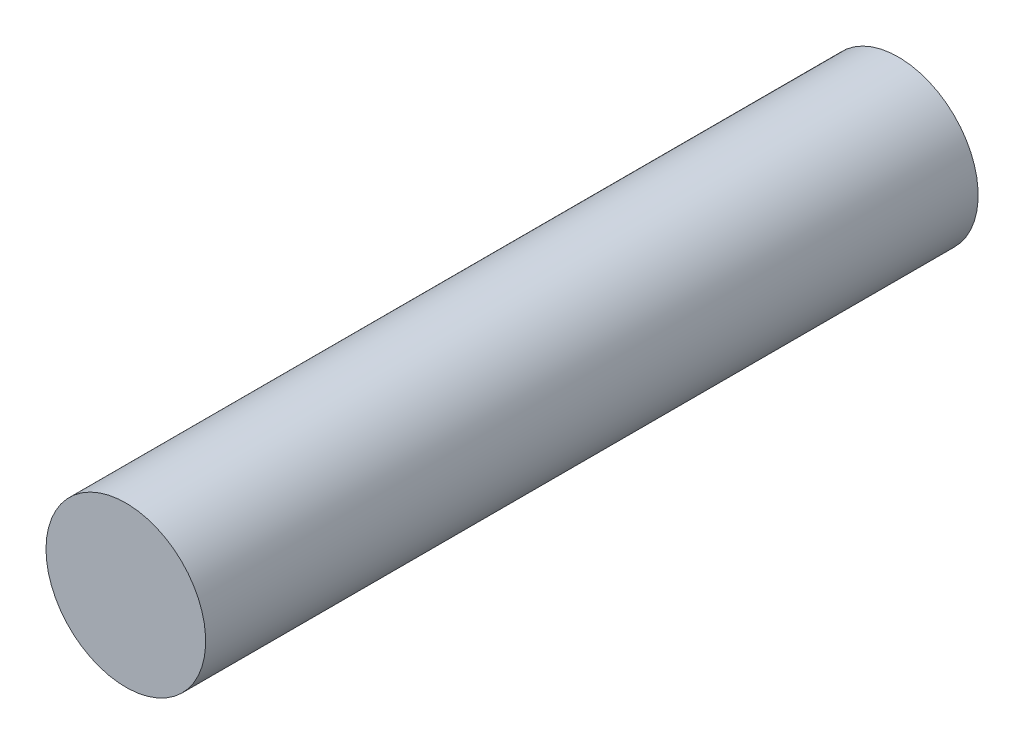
from build123d import *

# Parameters (mm, degrees)
SKETCH1_R           = 3.937
BOSS_EXTRUDE1_DEPTH = 38.1


with BuildPart() as part:
    # Sketch1 → Boss-Extrude1 (new body)
    with BuildSketch(Plane.XY):
        with Locations(Location((0, 0, 0), (0, 0, 180))):
            Circle(SKETCH1_R)
    extrude(amount=BOSS_EXTRUDE1_DEPTH)


solid = part.part
